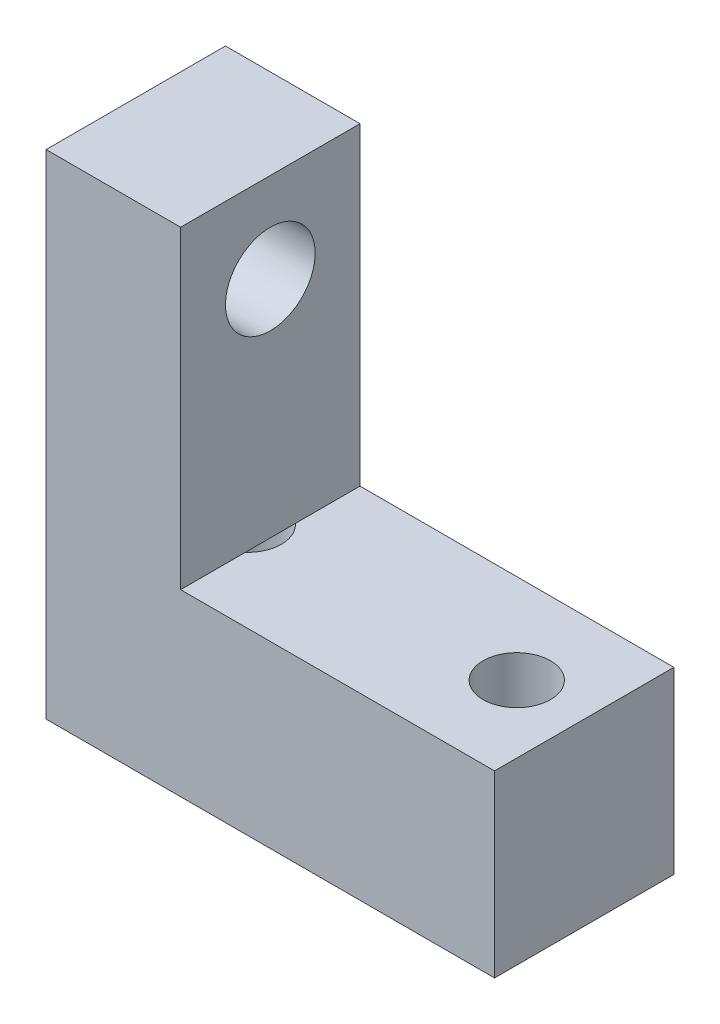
from build123d import *

# Parameters (mm, degrees)
BOSS_EXTRUDE1_DEPTH = 6.35
SKETCH6_R           = 2.3876
CUT_EXTRUDE1_DEPTH  = 12.7
SKETCH7_R           = 3.175
CUT_EXTRUDE2_DEPTH  = 17.78


with BuildPart() as part:
    # Sketch5 → Boss-Extrude1 (new, symmetric)
    with BuildSketch(Plane.XY):
        Polygon((0, 0), (31.75, 0), (31.75, 12.7), (9.525, 12.7), (9.525, 34.925), (0, 34.925), align=None)
    extrude(amount=BOSS_EXTRUDE1_DEPTH, both=True)

    # Sketch6 → Cut-Extrude1 (cut)
    with BuildSketch(Plane(origin=(0, 0, 0), x_dir=(1, 0, 0), z_dir=(0, 1, 0))):
        with Locations(Location((7.9248, 0, 0), (0, 0, 47.916511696))):
            Circle(SKETCH6_R)
        with Locations(Location((26.9748, 0, 0), (0, 0, 270))):
            Circle(SKETCH6_R)
    extrude(amount=CUT_EXTRUDE1_DEPTH, mode=Mode.SUBTRACT)

    # Sketch7 → Cut-Extrude2 (cut)
    with BuildSketch(Plane(origin=(0, 0, 0), x_dir=(0, 0, -1), z_dir=(1, 0, 0))):
        with Locations(Location((0, 28.575, 0), (0, 0, 270))):
            Circle(SKETCH7_R)
    extrude(amount=CUT_EXTRUDE2_DEPTH, mode=Mode.SUBTRACT)


solid = part.part
